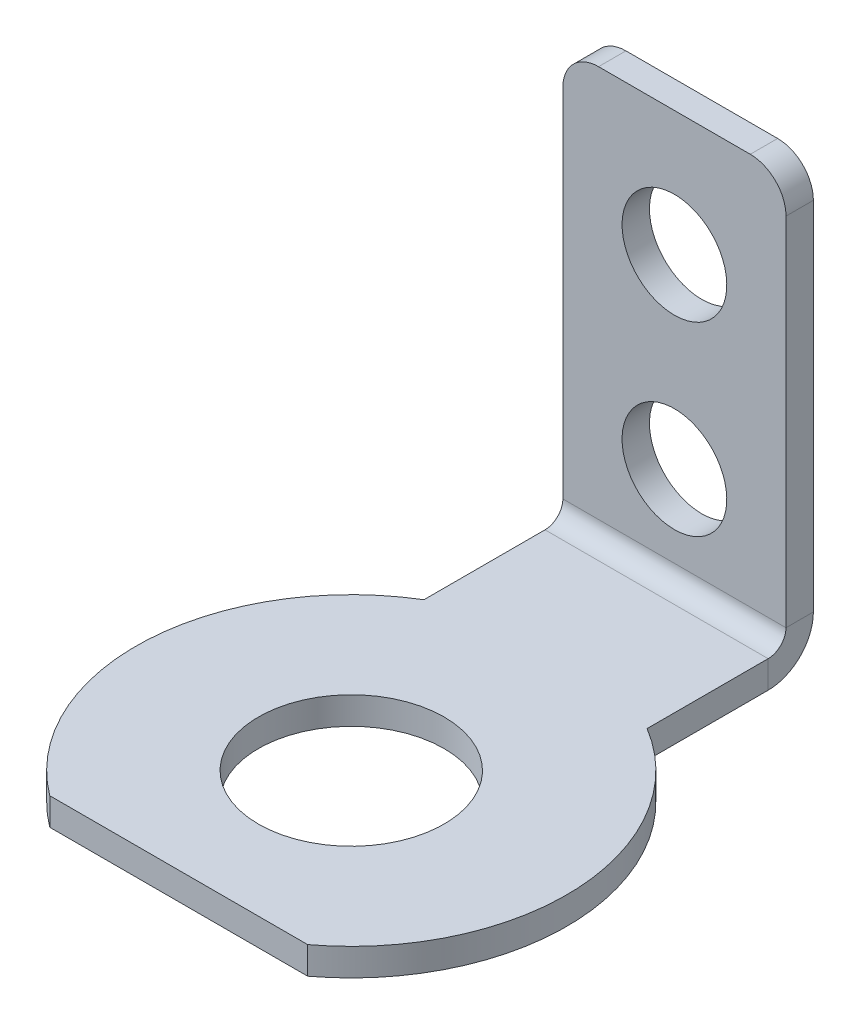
ISO-10303-21;
HEADER;
FILE_DESCRIPTION(('STEP AP214'),'2;1');
FILE_NAME('part.step','',(''),(''),'','','');
FILE_SCHEMA(('AUTOMOTIVE_DESIGN { 1 0 10303 214 1 1 1 1 }'));
ENDSEC;
DATA;
#1=APPLICATION_CONTEXT('core data for automotive mechanical design processes');
#2=APPLICATION_PROTOCOL_DEFINITION('international standard','automotive_design',2000,#1);
#3=PRODUCT_CONTEXT('',#1,'mechanical');
#4=PRODUCT('Part','Part','',(#3));
#5=PRODUCT_RELATED_PRODUCT_CATEGORY('part','',(#4));
#6=PRODUCT_DEFINITION_FORMATION('','',#4);
#7=PRODUCT_DEFINITION_CONTEXT('part definition',#1,'design');
#8=PRODUCT_DEFINITION('design','',#6,#7);
#9=PRODUCT_DEFINITION_SHAPE('','',#8);
#10=(LENGTH_UNIT() NAMED_UNIT(*) SI_UNIT(.MILLI.,.METRE.));
#11=(NAMED_UNIT(*) PLANE_ANGLE_UNIT() SI_UNIT($,.RADIAN.));
#12=(NAMED_UNIT(*) SI_UNIT($,.STERADIAN.) SOLID_ANGLE_UNIT());
#13=UNCERTAINTY_MEASURE_WITH_UNIT(LENGTH_MEASURE(1.E-05),#10,'distance_accuracy_value','');
#14=(GEOMETRIC_REPRESENTATION_CONTEXT(3) GLOBAL_UNCERTAINTY_ASSIGNED_CONTEXT((#13)) GLOBAL_UNIT_ASSIGNED_CONTEXT((#10,
#11,#12)) REPRESENTATION_CONTEXT('',''));
#15=CARTESIAN_POINT('',(0.,0.,0.));
#16=DIRECTION('',(0.,0.,1.));
#17=DIRECTION('',(1.,0.,0.));
#18=AXIS2_PLACEMENT_3D('',#15,#16,#17);
#19=CARTESIAN_POINT('',(0.,-7.12363928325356,-7.48136071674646));
#20=DIRECTION('',(0.,0.,1.));
#21=DIRECTION('',(0.,-1.,0.));
#22=AXIS2_PLACEMENT_3D('',#19,#20,#21);
#23=PLANE('',#22);
#24=CARTESIAN_POINT('',(0.,6.08436071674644,-7.48136071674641));
#25=DIRECTION('',(0.,0.,1.));
#26=DIRECTION('',(0.,-1.,0.));
#27=AXIS2_PLACEMENT_3D('',#24,#25,#26);
#28=CIRCLE('',#27,1.1176);
#29=CARTESIAN_POINT('',(0.,4.96676071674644,-7.48136071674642));
#30=VERTEX_POINT('',#29);
#31=EDGE_CURVE('E203',#30,#30,#28,.T.);
#32=ORIENTED_EDGE('',*,*,#31,.T.);
#33=EDGE_LOOP('',(#32));
#34=FACE_BOUND('',#33,.T.);
#35=CARTESIAN_POINT('',(0.,2.12196071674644,-7.48136071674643));
#36=DIRECTION('',(0.,0.,1.));
#37=DIRECTION('',(0.,-1.,0.));
#38=AXIS2_PLACEMENT_3D('',#35,#36,#37);
#39=CIRCLE('',#38,1.1176);
#40=CARTESIAN_POINT('',(0.,1.00436071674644,-7.48136071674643));
#41=VERTEX_POINT('',#40);
#42=EDGE_CURVE('E195',#41,#41,#39,.T.);
#43=ORIENTED_EDGE('',*,*,#42,.T.);
#44=EDGE_LOOP('',(#43));
#45=FACE_BOUND('',#44,.T.);
#46=DIRECTION('',(0.,1.,0.));
#47=VECTOR('',#46,1.);
#48=CARTESIAN_POINT('',(2.38125,8.75136071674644,-7.48136071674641));
#49=LINE('',#48,#47);
#50=CARTESIAN_POINT('',(2.38125,0.381000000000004,-7.48136071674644));
#51=VERTEX_POINT('',#50);
#52=CARTESIAN_POINT('',(2.38125,7.98936071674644,-7.48136071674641));
#53=VERTEX_POINT('',#52);
#54=EDGE_CURVE('E45',#51,#53,#49,.T.);
#55=ORIENTED_EDGE('',*,*,#54,.F.);
#56=DIRECTION('',(-1.,0.,0.));
#57=VECTOR('',#56,1.);
#58=CARTESIAN_POINT('',(0.,0.381000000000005,-7.48136071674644));
#59=LINE('',#58,#57);
#60=CARTESIAN_POINT('',(-2.38125,0.381,-7.48136071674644));
#61=VERTEX_POINT('',#60);
#62=EDGE_CURVE('E155',#51,#61,#59,.T.);
#63=ORIENTED_EDGE('',*,*,#62,.T.);
#64=DIRECTION('',(0.,-1.,0.));
#65=VECTOR('',#64,1.);
#66=CARTESIAN_POINT('',(-2.38125,8.75136071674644,-7.48136071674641));
#67=LINE('',#66,#65);
#68=CARTESIAN_POINT('',(-2.38125,7.98936071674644,-7.48136071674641));
#69=VERTEX_POINT('',#68);
#70=EDGE_CURVE('E211',#69,#61,#67,.T.);
#71=ORIENTED_EDGE('',*,*,#70,.F.);
#72=CARTESIAN_POINT('',(-1.61925,7.98936071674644,-7.48136071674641));
#73=DIRECTION('',(0.,0.,1.));
#74=DIRECTION('',(0.,-1.,0.));
#75=AXIS2_PLACEMENT_3D('',#72,#73,#74);
#76=CIRCLE('',#75,0.762);
#77=CARTESIAN_POINT('',(-1.61925,8.75136071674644,-7.48136071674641));
#78=VERTEX_POINT('',#77);
#79=EDGE_CURVE('E226',#69,#78,#76,.F.);
#80=ORIENTED_EDGE('',*,*,#79,.T.);
#81=DIRECTION('',(-1.,0.,0.));
#82=VECTOR('',#81,1.);
#83=CARTESIAN_POINT('',(-2.38125,8.75136071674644,-7.48136071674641));
#84=LINE('',#83,#82);
#85=CARTESIAN_POINT('',(1.61925,8.75136071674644,-7.48136071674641));
#86=VERTEX_POINT('',#85);
#87=EDGE_CURVE('E208',#86,#78,#84,.T.);
#88=ORIENTED_EDGE('',*,*,#87,.F.);
#89=CARTESIAN_POINT('',(1.61925,7.98936071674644,-7.48136071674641));
#90=DIRECTION('',(0.,0.,1.));
#91=DIRECTION('',(0.,-1.,0.));
#92=AXIS2_PLACEMENT_3D('',#89,#90,#91);
#93=CIRCLE('',#92,0.762);
#94=EDGE_CURVE('E228',#86,#53,#93,.F.);
#95=ORIENTED_EDGE('',*,*,#94,.T.);
#96=EDGE_LOOP('',(#55,#63,#71,#80,#88,#95));
#97=FACE_BOUND('',#96,.T.);
#98=ADVANCED_FACE('F41',(#34,#45,#97),#23,.F.);
#99=CARTESIAN_POINT('',(0.,-7.12363928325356,-6.89716071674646));
#100=DIRECTION('',(0.,0.,1.));
#101=DIRECTION('',(0.,-1.,0.));
#102=AXIS2_PLACEMENT_3D('',#99,#100,#101);
#103=PLANE('',#102);
#104=DIRECTION('',(-1.,0.,0.));
#105=VECTOR('',#104,1.);
#106=CARTESIAN_POINT('',(0.,0.381000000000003,-6.89716071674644));
#107=LINE('',#106,#105);
#108=CARTESIAN_POINT('',(2.38125,0.381000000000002,-6.89716071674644));
#109=VERTEX_POINT('',#108);
#110=CARTESIAN_POINT('',(-2.38125,0.381000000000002,-6.89716071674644));
#111=VERTEX_POINT('',#110);
#112=EDGE_CURVE('E50',#109,#111,#107,.T.);
#113=ORIENTED_EDGE('',*,*,#112,.F.);
#114=DIRECTION('',(0.,1.,0.));
#115=VECTOR('',#114,1.);
#116=CARTESIAN_POINT('',(2.38125,8.75136071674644,-6.89716071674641));
#117=LINE('',#116,#115);
#118=CARTESIAN_POINT('',(2.38125,7.98936071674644,-6.89716071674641));
#119=VERTEX_POINT('',#118);
#120=EDGE_CURVE('E66',#109,#119,#117,.T.);
#121=ORIENTED_EDGE('',*,*,#120,.T.);
#122=CARTESIAN_POINT('',(1.61925,7.98936071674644,-6.89716071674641));
#123=DIRECTION('',(0.,0.,1.));
#124=DIRECTION('',(0.,-1.,0.));
#125=AXIS2_PLACEMENT_3D('',#122,#123,#124);
#126=CIRCLE('',#125,0.762);
#127=CARTESIAN_POINT('',(1.61925,8.75136071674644,-6.89716071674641));
#128=VERTEX_POINT('',#127);
#129=EDGE_CURVE('E219',#119,#128,#126,.T.);
#130=ORIENTED_EDGE('',*,*,#129,.T.);
#131=DIRECTION('',(-1.,0.,0.));
#132=VECTOR('',#131,1.);
#133=CARTESIAN_POINT('',(-2.38125,8.75136071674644,-6.89716071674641));
#134=LINE('',#133,#132);
#135=CARTESIAN_POINT('',(-1.61925,8.75136071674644,-6.89716071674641));
#136=VERTEX_POINT('',#135);
#137=EDGE_CURVE('E212',#128,#136,#134,.T.);
#138=ORIENTED_EDGE('',*,*,#137,.T.);
#139=CARTESIAN_POINT('',(-1.61925,7.98936071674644,-6.89716071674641));
#140=DIRECTION('',(0.,0.,1.));
#141=DIRECTION('',(0.,-1.,0.));
#142=AXIS2_PLACEMENT_3D('',#139,#140,#141);
#143=CIRCLE('',#142,0.762);
#144=CARTESIAN_POINT('',(-2.38125,7.98936071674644,-6.89716071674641));
#145=VERTEX_POINT('',#144);
#146=EDGE_CURVE('E217',#136,#145,#143,.T.);
#147=ORIENTED_EDGE('',*,*,#146,.T.);
#148=DIRECTION('',(0.,-1.,0.));
#149=VECTOR('',#148,1.);
#150=CARTESIAN_POINT('',(-2.38125,8.75136071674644,-6.89716071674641));
#151=LINE('',#150,#149);
#152=EDGE_CURVE('E58',#145,#111,#151,.T.);
#153=ORIENTED_EDGE('',*,*,#152,.T.);
#154=EDGE_LOOP('',(#113,#121,#130,#138,#147,#153));
#155=FACE_BOUND('',#154,.T.);
#156=CARTESIAN_POINT('',(0.,2.12196071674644,-6.89716071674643));
#157=DIRECTION('',(0.,0.,1.));
#158=DIRECTION('',(0.,-1.,0.));
#159=AXIS2_PLACEMENT_3D('',#156,#157,#158);
#160=CIRCLE('',#159,1.1176);
#161=CARTESIAN_POINT('',(0.,1.00436071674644,-6.89716071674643));
#162=VERTEX_POINT('',#161);
#163=EDGE_CURVE('E199',#162,#162,#160,.T.);
#164=ORIENTED_EDGE('',*,*,#163,.F.);
#165=EDGE_LOOP('',(#164));
#166=FACE_BOUND('',#165,.T.);
#167=CARTESIAN_POINT('',(0.,6.08436071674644,-6.89716071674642));
#168=DIRECTION('',(0.,0.,1.));
#169=DIRECTION('',(0.,-1.,0.));
#170=AXIS2_PLACEMENT_3D('',#167,#168,#169);
#171=CIRCLE('',#170,1.1176);
#172=CARTESIAN_POINT('',(0.,4.96676071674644,-6.89716071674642));
#173=VERTEX_POINT('',#172);
#174=EDGE_CURVE('E198',#173,#173,#171,.T.);
#175=ORIENTED_EDGE('',*,*,#174,.F.);
#176=EDGE_LOOP('',(#175));
#177=FACE_BOUND('',#176,.T.);
#178=ADVANCED_FACE('F240',(#155,#166,#177),#103,.T.);
#179=CARTESIAN_POINT('',(2.38125,8.75136071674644,-7.48136071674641));
#180=DIRECTION('',(1.,0.,0.));
#181=DIRECTION('',(0.,1.,0.));
#182=AXIS2_PLACEMENT_3D('',#179,#180,#181);
#183=PLANE('',#182);
#184=DIRECTION('',(0.,0.,1.));
#185=VECTOR('',#184,1.);
#186=CARTESIAN_POINT('',(2.38125,0.381000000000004,-7.48136071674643));
#187=LINE('',#186,#185);
#188=EDGE_CURVE('E234',#51,#109,#187,.T.);
#189=ORIENTED_EDGE('',*,*,#188,.F.);
#190=ORIENTED_EDGE('',*,*,#54,.T.);
#191=DIRECTION('',(0.,0.,1.));
#192=VECTOR('',#191,1.);
#193=CARTESIAN_POINT('',(2.38125,7.98936071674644,-7.48136071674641));
#194=LINE('',#193,#192);
#195=EDGE_CURVE('E215',#53,#119,#194,.T.);
#196=ORIENTED_EDGE('',*,*,#195,.T.);
#197=ORIENTED_EDGE('',*,*,#120,.F.);
#198=EDGE_LOOP('',(#189,#190,#196,#197));
#199=FACE_BOUND('',#198,.T.);
#200=ADVANCED_FACE('F248',(#199),#183,.T.);
#201=CARTESIAN_POINT('',(-2.38125,8.75136071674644,-7.48136071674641));
#202=DIRECTION('',(-1.,0.,0.));
#203=DIRECTION('',(0.,-1.,0.));
#204=AXIS2_PLACEMENT_3D('',#201,#202,#203);
#205=PLANE('',#204);
#206=DIRECTION('',(0.,0.,-1.));
#207=VECTOR('',#206,1.);
#208=CARTESIAN_POINT('',(-2.38125,0.381000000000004,-7.48136071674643));
#209=LINE('',#208,#207);
#210=EDGE_CURVE('E12',#111,#61,#209,.T.);
#211=ORIENTED_EDGE('',*,*,#210,.F.);
#212=ORIENTED_EDGE('',*,*,#152,.F.);
#213=DIRECTION('',(0.,0.,1.));
#214=VECTOR('',#213,1.);
#215=CARTESIAN_POINT('',(-2.38125,7.98936071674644,-7.48136071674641));
#216=LINE('',#215,#214);
#217=EDGE_CURVE('E231',#145,#69,#216,.F.);
#218=ORIENTED_EDGE('',*,*,#217,.T.);
#219=ORIENTED_EDGE('',*,*,#70,.T.);
#220=EDGE_LOOP('',(#211,#212,#218,#219));
#221=FACE_BOUND('',#220,.T.);
#222=ADVANCED_FACE('F43',(#221),#205,.T.);
#223=CARTESIAN_POINT('',(-2.38125,8.75136071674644,-7.48136071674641));
#224=DIRECTION('',(0.,1.,0.));
#225=DIRECTION('',(-1.,0.,0.));
#226=AXIS2_PLACEMENT_3D('',#223,#224,#225);
#227=PLANE('',#226);
#228=ORIENTED_EDGE('',*,*,#137,.F.);
#229=DIRECTION('',(0.,0.,1.));
#230=VECTOR('',#229,1.);
#231=CARTESIAN_POINT('',(1.61925,8.75136071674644,-7.48136071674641));
#232=LINE('',#231,#230);
#233=EDGE_CURVE('E224',#128,#86,#232,.F.);
#234=ORIENTED_EDGE('',*,*,#233,.T.);
#235=ORIENTED_EDGE('',*,*,#87,.T.);
#236=DIRECTION('',(0.,0.,1.));
#237=VECTOR('',#236,1.);
#238=CARTESIAN_POINT('',(-1.61925,8.75136071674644,-7.48136071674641));
#239=LINE('',#238,#237);
#240=EDGE_CURVE('E221',#78,#136,#239,.T.);
#241=ORIENTED_EDGE('',*,*,#240,.T.);
#242=EDGE_LOOP('',(#228,#234,#235,#241));
#243=FACE_BOUND('',#242,.T.);
#244=ADVANCED_FACE('F255',(#243),#227,.T.);
#245=CARTESIAN_POINT('',(1.61925,7.98936071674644,-7.48136071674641));
#246=DIRECTION('',(0.,0.,1.));
#247=DIRECTION('',(0.,-1.,0.));
#248=AXIS2_PLACEMENT_3D('',#245,#246,#247);
#249=CYLINDRICAL_SURFACE('',#248,0.762);
#250=ORIENTED_EDGE('',*,*,#94,.F.);
#251=ORIENTED_EDGE('',*,*,#233,.F.);
#252=ORIENTED_EDGE('',*,*,#129,.F.);
#253=ORIENTED_EDGE('',*,*,#195,.F.);
#254=EDGE_LOOP('',(#250,#251,#252,#253));
#255=FACE_BOUND('',#254,.T.);
#256=ADVANCED_FACE('F247',(#255),#249,.T.);
#257=CARTESIAN_POINT('',(-1.61925,7.98936071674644,-7.48136071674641));
#258=DIRECTION('',(0.,0.,1.));
#259=DIRECTION('',(0.,-1.,0.));
#260=AXIS2_PLACEMENT_3D('',#257,#258,#259);
#261=CYLINDRICAL_SURFACE('',#260,0.762);
#262=ORIENTED_EDGE('',*,*,#79,.F.);
#263=ORIENTED_EDGE('',*,*,#217,.F.);
#264=ORIENTED_EDGE('',*,*,#146,.F.);
#265=ORIENTED_EDGE('',*,*,#240,.F.);
#266=EDGE_LOOP('',(#262,#263,#264,#265));
#267=FACE_BOUND('',#266,.T.);
#268=ADVANCED_FACE('F257',(#267),#261,.T.);
#269=CARTESIAN_POINT('',(0.,6.08436071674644,-7.48136071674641));
#270=DIRECTION('',(0.,0.,1.));
#271=DIRECTION('',(0.,-1.,0.));
#272=AXIS2_PLACEMENT_3D('',#269,#270,#271);
#273=CYLINDRICAL_SURFACE('',#272,1.1176);
#274=ORIENTED_EDGE('',*,*,#31,.F.);
#275=EDGE_LOOP('',(#274));
#276=FACE_BOUND('',#275,.T.);
#277=ORIENTED_EDGE('',*,*,#174,.T.);
#278=EDGE_LOOP('',(#277));
#279=FACE_BOUND('',#278,.T.);
#280=ADVANCED_FACE('F333',(#276,#279),#273,.F.);
#281=CARTESIAN_POINT('',(0.,2.12196071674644,-7.48136071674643));
#282=DIRECTION('',(0.,0.,1.));
#283=DIRECTION('',(0.,-1.,0.));
#284=AXIS2_PLACEMENT_3D('',#281,#282,#283);
#285=CYLINDRICAL_SURFACE('',#284,1.1176);
#286=ORIENTED_EDGE('',*,*,#42,.F.);
#287=EDGE_LOOP('',(#286));
#288=FACE_BOUND('',#287,.T.);
#289=ORIENTED_EDGE('',*,*,#163,.T.);
#290=EDGE_LOOP('',(#289));
#291=FACE_BOUND('',#290,.T.);
#292=ADVANCED_FACE('F336',(#288,#291),#285,.F.);
#293=CARTESIAN_POINT('',(0.,-0.5842,0.));
#294=DIRECTION('',(0.,1.,0.));
#295=DIRECTION('',(0.,0.,1.));
#296=AXIS2_PLACEMENT_3D('',#293,#294,#295);
#297=CYLINDRICAL_SURFACE('',#296,1.9812);
#298=CARTESIAN_POINT('',(0.,-0.5842,0.));
#299=DIRECTION('',(0.,1.,0.));
#300=DIRECTION('',(0.,0.,1.));
#301=AXIS2_PLACEMENT_3D('',#298,#299,#300);
#302=CIRCLE('',#301,1.9812);
#303=CARTESIAN_POINT('',(0.,-0.5842,1.9812));
#304=VERTEX_POINT('',#303);
#305=EDGE_CURVE('E173',#304,#304,#302,.T.);
#306=ORIENTED_EDGE('',*,*,#305,.F.);
#307=EDGE_LOOP('',(#306));
#308=FACE_BOUND('',#307,.T.);
#309=CARTESIAN_POINT('',(0.,0.,0.));
#310=DIRECTION('',(0.,1.,0.));
#311=DIRECTION('',(0.,0.,1.));
#312=AXIS2_PLACEMENT_3D('',#309,#310,#311);
#313=CIRCLE('',#312,1.9812);
#314=CARTESIAN_POINT('',(0.,0.,1.9812));
#315=VERTEX_POINT('',#314);
#316=EDGE_CURVE('E168',#315,#315,#313,.T.);
#317=ORIENTED_EDGE('',*,*,#316,.T.);
#318=EDGE_LOOP('',(#317));
#319=FACE_BOUND('',#318,.T.);
#320=ADVANCED_FACE('F309',(#308,#319),#297,.F.);
#321=CARTESIAN_POINT('',(0.,-0.5842,0.));
#322=DIRECTION('',(0.,1.,0.));
#323=DIRECTION('',(0.,0.,1.));
#324=AXIS2_PLACEMENT_3D('',#321,#322,#323);
#325=CYLINDRICAL_SURFACE('',#324,4.5974);
#326=CARTESIAN_POINT('',(0.,-0.5842,0.));
#327=DIRECTION('',(0.,1.,0.));
#328=DIRECTION('',(0.,0.,1.));
#329=AXIS2_PLACEMENT_3D('',#326,#327,#328);
#330=CIRCLE('',#329,4.5974);
#331=CARTESIAN_POINT('',(-2.38125,-0.5842,-3.9326498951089));
#332=VERTEX_POINT('',#331);
#333=CARTESIAN_POINT('',(-2.75165364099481,-0.5842,3.683));
#334=VERTEX_POINT('',#333);
#335=EDGE_CURVE('E183',#332,#334,#330,.T.);
#336=ORIENTED_EDGE('',*,*,#335,.T.);
#337=DIRECTION('',(0.,1.,0.));
#338=VECTOR('',#337,1.);
#339=CARTESIAN_POINT('',(-2.75165364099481,0.,3.683));
#340=LINE('',#339,#338);
#341=CARTESIAN_POINT('',(-2.75165364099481,0.,3.683));
#342=VERTEX_POINT('',#341);
#343=EDGE_CURVE('E190',#342,#334,#340,.F.);
#344=ORIENTED_EDGE('',*,*,#343,.F.);
#345=CARTESIAN_POINT('',(0.,0.,0.));
#346=DIRECTION('',(0.,1.,0.));
#347=DIRECTION('',(0.,0.,1.));
#348=AXIS2_PLACEMENT_3D('',#345,#346,#347);
#349=CIRCLE('',#348,4.5974);
#350=CARTESIAN_POINT('',(-2.38125,0.,-3.9326498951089));
#351=VERTEX_POINT('',#350);
#352=EDGE_CURVE('E280',#351,#342,#349,.T.);
#353=ORIENTED_EDGE('',*,*,#352,.F.);
#354=DIRECTION('',(0.,1.,0.));
#355=VECTOR('',#354,1.);
#356=CARTESIAN_POINT('',(-2.38125,-0.5842,-3.9326498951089));
#357=LINE('',#356,#355);
#358=EDGE_CURVE('E202',#332,#351,#357,.T.);
#359=ORIENTED_EDGE('',*,*,#358,.F.);
#360=EDGE_LOOP('',(#336,#344,#353,#359));
#361=FACE_BOUND('',#360,.T.);
#362=ADVANCED_FACE('F297',(#361),#325,.T.);
#363=CARTESIAN_POINT('',(0.,0.,3.683));
#364=DIRECTION('',(0.,0.,-1.));
#365=DIRECTION('',(-1.,0.,0.));
#366=AXIS2_PLACEMENT_3D('',#363,#364,#365);
#367=PLANE('',#366);
#368=DIRECTION('',(-1.,0.,0.));
#369=VECTOR('',#368,1.);
#370=CARTESIAN_POINT('',(0.,0.,3.683));
#371=LINE('',#370,#369);
#372=CARTESIAN_POINT('',(2.75165364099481,0.,3.683));
#373=VERTEX_POINT('',#372);
#374=EDGE_CURVE('E186',#373,#342,#371,.T.);
#375=ORIENTED_EDGE('',*,*,#374,.T.);
#376=ORIENTED_EDGE('',*,*,#343,.T.);
#377=DIRECTION('',(1.,0.,0.));
#378=VECTOR('',#377,1.);
#379=CARTESIAN_POINT('',(0.,-0.5842,3.683));
#380=LINE('',#379,#378);
#381=CARTESIAN_POINT('',(2.75165364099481,-0.5842,3.683));
#382=VERTEX_POINT('',#381);
#383=EDGE_CURVE('E176',#382,#334,#380,.F.);
#384=ORIENTED_EDGE('',*,*,#383,.F.);
#385=DIRECTION('',(0.,1.,0.));
#386=VECTOR('',#385,1.);
#387=CARTESIAN_POINT('',(2.75165364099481,0.,3.683));
#388=LINE('',#387,#386);
#389=EDGE_CURVE('E187',#373,#382,#388,.F.);
#390=ORIENTED_EDGE('',*,*,#389,.F.);
#391=EDGE_LOOP('',(#375,#376,#384,#390));
#392=FACE_BOUND('',#391,.T.);
#393=ADVANCED_FACE('F301',(#392),#367,.F.);
#394=CARTESIAN_POINT('',(2.38125,0.,-3.9326498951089));
#395=VERTEX_POINT('',#394);
#396=EDGE_CURVE('E279',#373,#395,#349,.T.);
#397=ORIENTED_EDGE('',*,*,#396,.F.);
#398=ORIENTED_EDGE('',*,*,#389,.T.);
#399=CARTESIAN_POINT('',(2.38125,-0.5842,-3.9326498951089));
#400=VERTEX_POINT('',#399);
#401=EDGE_CURVE('E182',#382,#400,#330,.T.);
#402=ORIENTED_EDGE('',*,*,#401,.T.);
#403=DIRECTION('',(0.,1.,0.));
#404=VECTOR('',#403,1.);
#405=CARTESIAN_POINT('',(2.38125,-0.5842,-3.9326498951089));
#406=LINE('',#405,#404);
#407=EDGE_CURVE('E145',#395,#400,#406,.F.);
#408=ORIENTED_EDGE('',*,*,#407,.F.);
#409=EDGE_LOOP('',(#397,#398,#402,#408));
#410=FACE_BOUND('',#409,.T.);
#411=ADVANCED_FACE('F292',(#410),#325,.T.);
#412=CARTESIAN_POINT('',(0.,-0.5842,0.));
#413=DIRECTION('',(0.,1.,0.));
#414=DIRECTION('',(0.,0.,1.));
#415=AXIS2_PLACEMENT_3D('',#412,#413,#414);
#416=PLANE('',#415);
#417=DIRECTION('',(-1.,0.,0.));
#418=VECTOR('',#417,1.);
#419=CARTESIAN_POINT('',(0.,-0.5842,-6.51616071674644));
#420=LINE('',#419,#418);
#421=CARTESIAN_POINT('',(2.38125,-0.5842,-6.51616071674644));
#422=VERTEX_POINT('',#421);
#423=CARTESIAN_POINT('',(-2.38125,-0.5842,-6.51616071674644));
#424=VERTEX_POINT('',#423);
#425=EDGE_CURVE('E152',#422,#424,#420,.T.);
#426=ORIENTED_EDGE('',*,*,#425,.F.);
#427=DIRECTION('',(0.,0.,-1.));
#428=VECTOR('',#427,1.);
#429=CARTESIAN_POINT('',(2.38125,-0.5842,-15.875));
#430=LINE('',#429,#428);
#431=EDGE_CURVE('E146',#400,#422,#430,.T.);
#432=ORIENTED_EDGE('',*,*,#431,.F.);
#433=ORIENTED_EDGE('',*,*,#401,.F.);
#434=ORIENTED_EDGE('',*,*,#383,.T.);
#435=ORIENTED_EDGE('',*,*,#335,.F.);
#436=DIRECTION('',(0.,0.,1.));
#437=VECTOR('',#436,1.);
#438=CARTESIAN_POINT('',(-2.38125,-0.5842,-15.875));
#439=LINE('',#438,#437);
#440=EDGE_CURVE('E166',#424,#332,#439,.T.);
#441=ORIENTED_EDGE('',*,*,#440,.F.);
#442=EDGE_LOOP('',(#426,#432,#433,#434,#435,#441));
#443=FACE_BOUND('',#442,.T.);
#444=ORIENTED_EDGE('',*,*,#305,.T.);
#445=EDGE_LOOP('',(#444));
#446=FACE_BOUND('',#445,.T.);
#447=ADVANCED_FACE('F162',(#443,#446),#416,.F.);
#448=CARTESIAN_POINT('',(2.38125,-0.5842,-15.875));
#449=DIRECTION('',(1.,0.,0.));
#450=DIRECTION('',(0.,0.,-1.));
#451=AXIS2_PLACEMENT_3D('',#448,#449,#450);
#452=PLANE('',#451);
#453=ORIENTED_EDGE('',*,*,#431,.T.);
#454=DIRECTION('',(0.,1.,0.));
#455=VECTOR('',#454,1.);
#456=CARTESIAN_POINT('',(2.38125,-0.584199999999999,-6.51616071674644));
#457=LINE('',#456,#455);
#458=CARTESIAN_POINT('',(2.38125,0.,-6.51616071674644));
#459=VERTEX_POINT('',#458);
#460=EDGE_CURVE('E133',#422,#459,#457,.T.);
#461=ORIENTED_EDGE('',*,*,#460,.T.);
#462=DIRECTION('',(0.,0.,-1.));
#463=VECTOR('',#462,1.);
#464=CARTESIAN_POINT('',(2.38125,0.,-15.875));
#465=LINE('',#464,#463);
#466=EDGE_CURVE('E286',#395,#459,#465,.T.);
#467=ORIENTED_EDGE('',*,*,#466,.F.);
#468=ORIENTED_EDGE('',*,*,#407,.T.);
#469=EDGE_LOOP('',(#453,#461,#467,#468));
#470=FACE_BOUND('',#469,.T.);
#471=ADVANCED_FACE('F171',(#470),#452,.T.);
#472=CARTESIAN_POINT('',(0.,0.,0.));
#473=DIRECTION('',(0.,1.,0.));
#474=DIRECTION('',(0.,0.,1.));
#475=AXIS2_PLACEMENT_3D('',#472,#473,#474);
#476=PLANE('',#475);
#477=ORIENTED_EDGE('',*,*,#316,.F.);
#478=EDGE_LOOP('',(#477));
#479=FACE_BOUND('',#478,.T.);
#480=ORIENTED_EDGE('',*,*,#466,.T.);
#481=DIRECTION('',(-1.,0.,0.));
#482=VECTOR('',#481,1.);
#483=CARTESIAN_POINT('',(0.,0.,-6.51616071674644));
#484=LINE('',#483,#482);
#485=CARTESIAN_POINT('',(-2.38125,0.,-6.51616071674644));
#486=VERTEX_POINT('',#485);
#487=EDGE_CURVE('E270',#459,#486,#484,.T.);
#488=ORIENTED_EDGE('',*,*,#487,.T.);
#489=DIRECTION('',(0.,0.,1.));
#490=VECTOR('',#489,1.);
#491=CARTESIAN_POINT('',(-2.38125,0.,-15.875));
#492=LINE('',#491,#490);
#493=EDGE_CURVE('E283',#486,#351,#492,.T.);
#494=ORIENTED_EDGE('',*,*,#493,.T.);
#495=ORIENTED_EDGE('',*,*,#352,.T.);
#496=ORIENTED_EDGE('',*,*,#374,.F.);
#497=ORIENTED_EDGE('',*,*,#396,.T.);
#498=EDGE_LOOP('',(#480,#488,#494,#495,#496,#497));
#499=FACE_BOUND('',#498,.T.);
#500=ADVANCED_FACE('F288',(#479,#499),#476,.T.);
#501=CARTESIAN_POINT('',(-2.38125,-0.5842,-15.875));
#502=DIRECTION('',(-1.,0.,0.));
#503=DIRECTION('',(0.,0.,1.));
#504=AXIS2_PLACEMENT_3D('',#501,#502,#503);
#505=PLANE('',#504);
#506=ORIENTED_EDGE('',*,*,#493,.F.);
#507=DIRECTION('',(0.,-1.,0.));
#508=VECTOR('',#507,1.);
#509=CARTESIAN_POINT('',(-2.38125,-0.584199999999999,-6.51616071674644));
#510=LINE('',#509,#508);
#511=EDGE_CURVE('E264',#486,#424,#510,.T.);
#512=ORIENTED_EDGE('',*,*,#511,.T.);
#513=ORIENTED_EDGE('',*,*,#440,.T.);
#514=ORIENTED_EDGE('',*,*,#358,.T.);
#515=EDGE_LOOP('',(#506,#512,#513,#514));
#516=FACE_BOUND('',#515,.T.);
#517=ADVANCED_FACE('F300',(#516),#505,.T.);
#518=CARTESIAN_POINT('',(2.38125,0.381,-6.51616071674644));
#519=DIRECTION('',(1.,0.,0.));
#520=DIRECTION('',(0.,0.,-1.));
#521=AXIS2_PLACEMENT_3D('',#518,#519,#520);
#522=PLANE('',#521);
#523=ORIENTED_EDGE('',*,*,#188,.T.);
#524=CARTESIAN_POINT('',(2.38125,0.381,-6.51616071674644));
#525=DIRECTION('',(1.,0.,0.));
#526=DIRECTION('',(0.,0.,-1.));
#527=AXIS2_PLACEMENT_3D('',#524,#525,#526);
#528=CIRCLE('',#527,0.381);
#529=EDGE_CURVE('E140',#109,#459,#528,.F.);
#530=ORIENTED_EDGE('',*,*,#529,.T.);
#531=ORIENTED_EDGE('',*,*,#460,.F.);
#532=CARTESIAN_POINT('',(2.38125,0.381,-6.51616071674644));
#533=DIRECTION('',(-1.,0.,0.));
#534=DIRECTION('',(0.,0.,-1.));
#535=AXIS2_PLACEMENT_3D('',#532,#533,#534);
#536=CIRCLE('',#535,0.9652);
#537=EDGE_CURVE('E137',#51,#422,#536,.T.);
#538=ORIENTED_EDGE('',*,*,#537,.F.);
#539=EDGE_LOOP('',(#523,#530,#531,#538));
#540=FACE_BOUND('',#539,.T.);
#541=ADVANCED_FACE('F136',(#540),#522,.T.);
#542=CARTESIAN_POINT('',(-2.38125,0.381,-6.51616071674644));
#543=DIRECTION('',(-1.,0.,0.));
#544=DIRECTION('',(0.,0.,1.));
#545=AXIS2_PLACEMENT_3D('',#542,#543,#544);
#546=PLANE('',#545);
#547=ORIENTED_EDGE('',*,*,#511,.F.);
#548=CARTESIAN_POINT('',(-2.38125,0.381,-6.51616071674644));
#549=DIRECTION('',(1.,0.,0.));
#550=DIRECTION('',(0.,0.,-1.));
#551=AXIS2_PLACEMENT_3D('',#548,#549,#550);
#552=CIRCLE('',#551,0.381);
#553=EDGE_CURVE('E157',#486,#111,#552,.T.);
#554=ORIENTED_EDGE('',*,*,#553,.T.);
#555=ORIENTED_EDGE('',*,*,#210,.T.);
#556=CARTESIAN_POINT('',(-2.38125,0.381,-6.51616071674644));
#557=DIRECTION('',(1.,0.,0.));
#558=DIRECTION('',(0.,0.,1.));
#559=AXIS2_PLACEMENT_3D('',#556,#557,#558);
#560=CIRCLE('',#559,0.9652);
#561=EDGE_CURVE('E156',#424,#61,#560,.T.);
#562=ORIENTED_EDGE('',*,*,#561,.F.);
#563=EDGE_LOOP('',(#547,#554,#555,#562));
#564=FACE_BOUND('',#563,.T.);
#565=ADVANCED_FACE('F263',(#564),#546,.T.);
#566=CARTESIAN_POINT('',(-4.89895762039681,0.381,-6.51616071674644));
#567=DIRECTION('',(1.,0.,0.));
#568=DIRECTION('',(0.,0.,-1.));
#569=AXIS2_PLACEMENT_3D('',#566,#567,#568);
#570=CYLINDRICAL_SURFACE('',#569,0.9652);
#571=ORIENTED_EDGE('',*,*,#561,.T.);
#572=ORIENTED_EDGE('',*,*,#62,.F.);
#573=ORIENTED_EDGE('',*,*,#537,.T.);
#574=ORIENTED_EDGE('',*,*,#425,.T.);
#575=EDGE_LOOP('',(#571,#572,#573,#574));
#576=FACE_BOUND('',#575,.T.);
#577=ADVANCED_FACE('F151',(#576),#570,.T.);
#578=CARTESIAN_POINT('',(-4.89895762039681,0.381,-6.51616071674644));
#579=DIRECTION('',(1.,0.,0.));
#580=DIRECTION('',(0.,0.,-1.));
#581=AXIS2_PLACEMENT_3D('',#578,#579,#580);
#582=CYLINDRICAL_SURFACE('',#581,0.381);
#583=ORIENTED_EDGE('',*,*,#553,.F.);
#584=ORIENTED_EDGE('',*,*,#487,.F.);
#585=ORIENTED_EDGE('',*,*,#529,.F.);
#586=ORIENTED_EDGE('',*,*,#112,.T.);
#587=EDGE_LOOP('',(#583,#584,#585,#586));
#588=FACE_BOUND('',#587,.T.);
#589=ADVANCED_FACE('F268',(#588),#582,.F.);
#590=CLOSED_SHELL('',(#98,#178,#200,#222,#244,#256,#268,#280,#292,#320,#362,#393,#411,#447,#471,
#500,#517,#541,#565,#577,#589));
#591=MANIFOLD_SOLID_BREP('B2',#590);
#592=ADVANCED_BREP_SHAPE_REPRESENTATION('',(#18,#591),#14);
#593=SHAPE_DEFINITION_REPRESENTATION(#9,#592);
ENDSEC;
END-ISO-10303-21;
